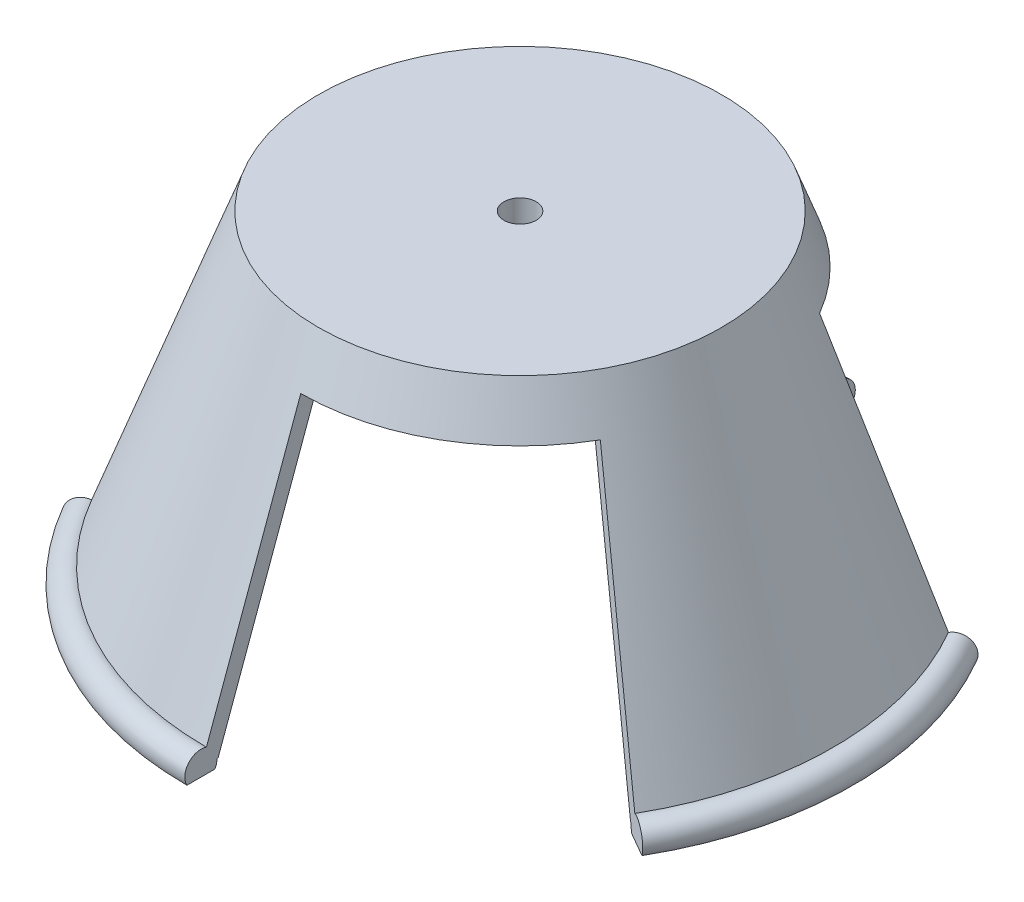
ISO-10303-21;
HEADER;
FILE_DESCRIPTION(('STEP AP214'),'2;1');
FILE_NAME('part.step','',(''),(''),'','','');
FILE_SCHEMA(('AUTOMOTIVE_DESIGN { 1 0 10303 214 1 1 1 1 }'));
ENDSEC;
DATA;
#1=APPLICATION_CONTEXT('core data for automotive mechanical design processes');
#2=APPLICATION_PROTOCOL_DEFINITION('international standard','automotive_design',2000,#1);
#3=PRODUCT_CONTEXT('',#1,'mechanical');
#4=PRODUCT('Part','Part','',(#3));
#5=PRODUCT_RELATED_PRODUCT_CATEGORY('part','',(#4));
#6=PRODUCT_DEFINITION_FORMATION('','',#4);
#7=PRODUCT_DEFINITION_CONTEXT('part definition',#1,'design');
#8=PRODUCT_DEFINITION('design','',#6,#7);
#9=PRODUCT_DEFINITION_SHAPE('','',#8);
#10=(LENGTH_UNIT() NAMED_UNIT(*) SI_UNIT(.MILLI.,.METRE.));
#11=(NAMED_UNIT(*) PLANE_ANGLE_UNIT() SI_UNIT($,.RADIAN.));
#12=(NAMED_UNIT(*) SI_UNIT($,.STERADIAN.) SOLID_ANGLE_UNIT());
#13=UNCERTAINTY_MEASURE_WITH_UNIT(LENGTH_MEASURE(1.E-05),#10,'distance_accuracy_value','');
#14=(GEOMETRIC_REPRESENTATION_CONTEXT(3) GLOBAL_UNCERTAINTY_ASSIGNED_CONTEXT((#13)) GLOBAL_UNIT_ASSIGNED_CONTEXT((#10,
#11,#12)) REPRESENTATION_CONTEXT('',''));
#15=CARTESIAN_POINT('',(0.,0.,0.));
#16=DIRECTION('',(0.,0.,1.));
#17=DIRECTION('',(1.,0.,0.));
#18=AXIS2_PLACEMENT_3D('',#15,#16,#17);
#19=CARTESIAN_POINT('',(0.,0.,0.));
#20=DIRECTION('',(0.,1.,0.));
#21=DIRECTION('',(0.,0.,1.));
#22=AXIS2_PLACEMENT_3D('',#19,#20,#21);
#23=TOROIDAL_SURFACE('',#22,19.7794046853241,1.);
#24=CARTESIAN_POINT('',(0.,-0.500000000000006,0.));
#25=DIRECTION('',(0.,-1.,0.));
#26=DIRECTION('',(0.,0.,-1.));
#27=AXIS2_PLACEMENT_3D('',#24,#25,#26);
#28=CIRCLE('',#27,18.9133792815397);
#29=CARTESIAN_POINT('',(0.,-0.500000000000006,-18.9133792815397));
#30=VERTEX_POINT('',#29);
#31=CARTESIAN_POINT('',(-16.3794669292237,-0.500000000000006,-9.45668964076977));
#32=VERTEX_POINT('',#31);
#33=EDGE_CURVE('E198',#30,#32,#28,.F.);
#34=ORIENTED_EDGE('',*,*,#33,.F.);
#35=CARTESIAN_POINT('',(0.,0.,-19.7794046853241));
#36=DIRECTION('',(-1.,0.,0.));
#37=DIRECTION('',(0.,0.,1.));
#38=AXIS2_PLACEMENT_3D('',#35,#36,#37);
#39=CIRCLE('',#38,1.);
#40=CARTESIAN_POINT('',(0.,0.,-18.7794046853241));
#41=VERTEX_POINT('',#40);
#42=EDGE_CURVE('E253',#41,#30,#39,.F.);
#43=ORIENTED_EDGE('',*,*,#42,.F.);
#44=CARTESIAN_POINT('',(0.,0.,0.));
#45=DIRECTION('',(0.,1.,0.));
#46=DIRECTION('',(0.,0.,1.));
#47=AXIS2_PLACEMENT_3D('',#44,#45,#46);
#48=CIRCLE('',#47,18.7794046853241);
#49=CARTESIAN_POINT('',(-16.2634415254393,0.,-9.38970234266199));
#50=VERTEX_POINT('',#49);
#51=EDGE_CURVE('E269',#41,#50,#48,.T.);
#52=ORIENTED_EDGE('',*,*,#51,.T.);
#53=CARTESIAN_POINT('',(-17.1294669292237,0.,-9.88970234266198));
#54=DIRECTION('',(0.499999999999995,0.,-0.866025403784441));
#55=DIRECTION('',(-0.866025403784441,0.,-0.499999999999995));
#56=AXIS2_PLACEMENT_3D('',#53,#54,#55);
#57=CIRCLE('',#56,1.);
#58=EDGE_CURVE('E216',#32,#50,#57,.F.);
#59=ORIENTED_EDGE('',*,*,#58,.F.);
#60=EDGE_LOOP('',(#34,#43,#52,#59));
#61=FACE_BOUND('',#60,.T.);
#62=ADVANCED_FACE('F51',(#61),#23,.T.);
#63=CARTESIAN_POINT('',(0.,-0.500000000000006,0.));
#64=DIRECTION('',(0.,-1.,0.));
#65=DIRECTION('',(0.,0.,-1.));
#66=AXIS2_PLACEMENT_3D('',#63,#64,#65);
#67=CIRCLE('',#66,18.9133792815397);
#68=CARTESIAN_POINT('',(-16.3794669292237,-0.500000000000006,9.45668964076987));
#69=VERTEX_POINT('',#68);
#70=CARTESIAN_POINT('',(1.88982622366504E-13,-0.500000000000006,18.9133792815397));
#71=VERTEX_POINT('',#70);
#72=EDGE_CURVE('E346',#69,#71,#67,.F.);
#73=ORIENTED_EDGE('',*,*,#72,.F.);
#74=CARTESIAN_POINT('',(-17.1294669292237,0.,9.88970234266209));
#75=DIRECTION('',(0.500000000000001,0.,0.866025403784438));
#76=DIRECTION('',(0.866025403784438,0.,-0.500000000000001));
#77=AXIS2_PLACEMENT_3D('',#74,#75,#76);
#78=CIRCLE('',#77,1.);
#79=CARTESIAN_POINT('',(-16.2634415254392,0.,9.38970234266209));
#80=VERTEX_POINT('',#79);
#81=EDGE_CURVE('E227',#80,#69,#78,.F.);
#82=ORIENTED_EDGE('',*,*,#81,.F.);
#83=CARTESIAN_POINT('',(1.87643947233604E-13,0.,18.7794046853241));
#84=VERTEX_POINT('',#83);
#85=EDGE_CURVE('E273',#80,#84,#48,.T.);
#86=ORIENTED_EDGE('',*,*,#85,.T.);
#87=CARTESIAN_POINT('',(1.9763595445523E-13,0.,19.7794046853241));
#88=DIRECTION('',(-1.,0.,0.));
#89=DIRECTION('',(0.,0.,1.));
#90=AXIS2_PLACEMENT_3D('',#87,#88,#89);
#91=CIRCLE('',#90,1.);
#92=EDGE_CURVE('E347',#71,#84,#91,.F.);
#93=ORIENTED_EDGE('',*,*,#92,.F.);
#94=EDGE_LOOP('',(#73,#82,#86,#93));
#95=FACE_BOUND('',#94,.T.);
#96=ADVANCED_FACE('F344',(#95),#23,.T.);
#97=CARTESIAN_POINT('',(0.,-0.500000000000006,0.));
#98=DIRECTION('',(0.,-1.,0.));
#99=DIRECTION('',(0.,0.,-1.));
#100=AXIS2_PLACEMENT_3D('',#97,#98,#99);
#101=CIRCLE('',#100,18.9133792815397);
#102=CARTESIAN_POINT('',(16.3794669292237,-0.500000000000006,9.45668964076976));
#103=VERTEX_POINT('',#102);
#104=CARTESIAN_POINT('',(16.3794669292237,-0.500000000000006,-9.45668964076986));
#105=VERTEX_POINT('',#104);
#106=EDGE_CURVE('E358',#103,#105,#101,.F.);
#107=ORIENTED_EDGE('',*,*,#106,.F.);
#108=CARTESIAN_POINT('',(17.1294669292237,0.,9.88970234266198));
#109=DIRECTION('',(0.499999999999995,0.,-0.866025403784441));
#110=DIRECTION('',(-0.866025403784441,0.,-0.499999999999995));
#111=AXIS2_PLACEMENT_3D('',#108,#109,#110);
#112=CIRCLE('',#111,1.);
#113=CARTESIAN_POINT('',(16.2634415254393,0.,9.38970234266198));
#114=VERTEX_POINT('',#113);
#115=EDGE_CURVE('E380',#114,#103,#112,.F.);
#116=ORIENTED_EDGE('',*,*,#115,.F.);
#117=CARTESIAN_POINT('',(16.2634415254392,0.,-9.38970234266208));
#118=VERTEX_POINT('',#117);
#119=EDGE_CURVE('E262',#114,#118,#48,.T.);
#120=ORIENTED_EDGE('',*,*,#119,.T.);
#121=CARTESIAN_POINT('',(17.1294669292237,0.,-9.88970234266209));
#122=DIRECTION('',(0.500000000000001,0.,0.866025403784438));
#123=DIRECTION('',(0.866025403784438,0.,-0.500000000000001));
#124=AXIS2_PLACEMENT_3D('',#121,#122,#123);
#125=CIRCLE('',#124,1.);
#126=EDGE_CURVE('E243',#105,#118,#125,.F.);
#127=ORIENTED_EDGE('',*,*,#126,.F.);
#128=EDGE_LOOP('',(#107,#116,#120,#127));
#129=FACE_BOUND('',#128,.T.);
#130=ADVANCED_FACE('F427',(#129),#23,.T.);
#131=CARTESIAN_POINT('',(0.,-0.500000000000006,0.));
#132=DIRECTION('',(0.,1.,0.));
#133=DIRECTION('',(0.,0.,1.));
#134=AXIS2_PLACEMENT_3D('',#131,#132,#133);
#135=CIRCLE('',#134,20.6454300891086);
#136=CARTESIAN_POINT('',(-17.8794669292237,-0.500000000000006,-10.3227150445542));
#137=VERTEX_POINT('',#136);
#138=CARTESIAN_POINT('',(0.,-0.500000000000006,-20.6454300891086));
#139=VERTEX_POINT('',#138);
#140=EDGE_CURVE('E195',#137,#139,#135,.F.);
#141=ORIENTED_EDGE('',*,*,#140,.F.);
#142=CARTESIAN_POINT('',(-16.8332687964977,0.939692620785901,-9.71869227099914));
#143=VERTEX_POINT('',#142);
#144=EDGE_CURVE('E207',#143,#137,#57,.F.);
#145=ORIENTED_EDGE('',*,*,#144,.F.);
#146=CARTESIAN_POINT('',(0.,0.939692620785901,0.));
#147=DIRECTION('',(0.,1.,0.));
#148=DIRECTION('',(0.,0.,1.));
#149=AXIS2_PLACEMENT_3D('',#146,#147,#148);
#150=CIRCLE('',#149,19.4373845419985);
#151=CARTESIAN_POINT('',(0.,0.939692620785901,-19.4373845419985));
#152=VERTEX_POINT('',#151);
#153=EDGE_CURVE('E274',#152,#143,#150,.T.);
#154=ORIENTED_EDGE('',*,*,#153,.F.);
#155=EDGE_CURVE('E209',#139,#152,#39,.F.);
#156=ORIENTED_EDGE('',*,*,#155,.F.);
#157=EDGE_LOOP('',(#141,#145,#154,#156));
#158=FACE_BOUND('',#157,.T.);
#159=ADVANCED_FACE('F205',(#158),#23,.T.);
#160=CARTESIAN_POINT('',(0.,-0.500000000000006,0.));
#161=DIRECTION('',(0.,1.,0.));
#162=DIRECTION('',(0.,0.,1.));
#163=AXIS2_PLACEMENT_3D('',#160,#161,#162);
#164=CIRCLE('',#163,20.6454300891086);
#165=CARTESIAN_POINT('',(2.06289286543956E-13,-0.500000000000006,20.6454300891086));
#166=VERTEX_POINT('',#165);
#167=CARTESIAN_POINT('',(-17.8794669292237,-0.500000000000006,10.3227150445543));
#168=VERTEX_POINT('',#167);
#169=EDGE_CURVE('E75',#166,#168,#164,.F.);
#170=ORIENTED_EDGE('',*,*,#169,.F.);
#171=CARTESIAN_POINT('',(1.94218486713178E-13,0.939692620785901,19.4373845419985));
#172=VERTEX_POINT('',#171);
#173=EDGE_CURVE('E373',#172,#166,#91,.F.);
#174=ORIENTED_EDGE('',*,*,#173,.F.);
#175=CARTESIAN_POINT('',(-16.8332687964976,0.939692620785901,9.71869227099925));
#176=VERTEX_POINT('',#175);
#177=EDGE_CURVE('E277',#176,#172,#150,.T.);
#178=ORIENTED_EDGE('',*,*,#177,.F.);
#179=EDGE_CURVE('E226',#168,#176,#78,.F.);
#180=ORIENTED_EDGE('',*,*,#179,.F.);
#181=EDGE_LOOP('',(#170,#174,#178,#180));
#182=FACE_BOUND('',#181,.T.);
#183=ADVANCED_FACE('F431',(#182),#23,.T.);
#184=CARTESIAN_POINT('',(0.,0.,0.));
#185=DIRECTION('',(0.,-1.,0.));
#186=DIRECTION('',(0.,0.,-1.));
#187=AXIS2_PLACEMENT_3D('',#184,#185,#186);
#188=PLANE('',#187);
#189=DIRECTION('',(-0.866025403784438,0.,0.500000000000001));
#190=VECTOR('',#189,1.);
#191=CARTESIAN_POINT('',(0.,0.,0.));
#192=LINE('',#191,#190);
#193=CARTESIAN_POINT('',(-16.2078619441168,0.,9.35761345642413));
#194=VERTEX_POINT('',#193);
#195=EDGE_CURVE('E218',#194,#80,#192,.T.);
#196=ORIENTED_EDGE('',*,*,#195,.F.);
#197=CARTESIAN_POINT('',(0.,0.,0.));
#198=DIRECTION('',(0.,-1.,0.));
#199=DIRECTION('',(0.,0.,-1.));
#200=AXIS2_PLACEMENT_3D('',#197,#198,#199);
#201=CIRCLE('',#200,18.7152269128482);
#202=CARTESIAN_POINT('',(1.87002682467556E-13,0.,18.7152269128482));
#203=VERTEX_POINT('',#202);
#204=EDGE_CURVE('E268',#194,#203,#201,.F.);
#205=ORIENTED_EDGE('',*,*,#204,.T.);
#206=DIRECTION('',(0.,0.,-1.));
#207=VECTOR('',#206,1.);
#208=CARTESIAN_POINT('',(0.,0.,0.));
#209=LINE('',#208,#207);
#210=EDGE_CURVE('E337',#84,#203,#209,.T.);
#211=ORIENTED_EDGE('',*,*,#210,.F.);
#212=ORIENTED_EDGE('',*,*,#85,.F.);
#213=EDGE_LOOP('',(#196,#205,#211,#212));
#214=FACE_BOUND('',#213,.T.);
#215=ADVANCED_FACE('F335',(#214),#188,.T.);
#216=DIRECTION('',(0.866025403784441,0.,0.499999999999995));
#217=VECTOR('',#216,1.);
#218=CARTESIAN_POINT('',(0.,0.,0.));
#219=LINE('',#218,#217);
#220=CARTESIAN_POINT('',(16.2078619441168,0.,9.35761345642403));
#221=VERTEX_POINT('',#220);
#222=EDGE_CURVE('E332',#221,#114,#219,.T.);
#223=ORIENTED_EDGE('',*,*,#222,.F.);
#224=CARTESIAN_POINT('',(16.2078619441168,0.,-9.35761345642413));
#225=VERTEX_POINT('',#224);
#226=EDGE_CURVE('E258',#221,#225,#201,.F.);
#227=ORIENTED_EDGE('',*,*,#226,.T.);
#228=DIRECTION('',(-0.866025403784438,0.,0.500000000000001));
#229=VECTOR('',#228,1.);
#230=CARTESIAN_POINT('',(0.,0.,0.));
#231=LINE('',#230,#229);
#232=EDGE_CURVE('E240',#118,#225,#231,.T.);
#233=ORIENTED_EDGE('',*,*,#232,.F.);
#234=ORIENTED_EDGE('',*,*,#119,.F.);
#235=EDGE_LOOP('',(#223,#227,#233,#234));
#236=FACE_BOUND('',#235,.T.);
#237=ADVANCED_FACE('F330',(#236),#188,.T.);
#238=CARTESIAN_POINT('',(0.,19.6579798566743,0.));
#239=DIRECTION('',(0.,-1.,0.));
#240=DIRECTION('',(0.,0.,-1.));
#241=AXIS2_PLACEMENT_3D('',#238,#239,#240);
#242=CONICAL_SURFACE('',#241,11.5603073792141,0.34906585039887);
#243=ORIENTED_EDGE('',*,*,#204,.F.);
#244=DIRECTION('',(-0.296198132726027,-0.939692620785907,0.171010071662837));
#245=VECTOR('',#244,1.);
#246=CARTESIAN_POINT('',(0.,51.4196633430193,0.));
#247=LINE('',#246,#245);
#248=CARTESIAN_POINT('',(-10.8493349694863,17.,6.26386646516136));
#249=VERTEX_POINT('',#248);
#250=EDGE_CURVE('E60',#194,#249,#247,.F.);
#251=ORIENTED_EDGE('',*,*,#250,.T.);
#252=CARTESIAN_POINT('',(0.,17.,0.));
#253=DIRECTION('',(0.,1.,0.));
#254=DIRECTION('',(0.,0.,1.));
#255=AXIS2_PLACEMENT_3D('',#252,#253,#254);
#256=CIRCLE('',#255,12.5277329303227);
#257=CARTESIAN_POINT('',(1.25177197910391E-13,17.,12.5277329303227));
#258=VERTEX_POINT('',#257);
#259=EDGE_CURVE('E263',#249,#258,#256,.T.);
#260=ORIENTED_EDGE('',*,*,#259,.T.);
#261=DIRECTION('',(0.,0.939692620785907,-0.342020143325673));
#262=VECTOR('',#261,1.);
#263=CARTESIAN_POINT('',(0.,51.4196633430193,0.));
#264=LINE('',#263,#262);
#265=EDGE_CURVE('E286',#258,#203,#264,.F.);
#266=ORIENTED_EDGE('',*,*,#265,.T.);
#267=EDGE_LOOP('',(#243,#251,#260,#266));
#268=FACE_BOUND('',#267,.T.);
#269=ADVANCED_FACE('F300',(#268),#242,.F.);
#270=ORIENTED_EDGE('',*,*,#226,.F.);
#271=DIRECTION('',(0.296198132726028,-0.939692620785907,0.171010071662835));
#272=VECTOR('',#271,1.);
#273=CARTESIAN_POINT('',(0.,51.4196633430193,0.));
#274=LINE('',#273,#272);
#275=CARTESIAN_POINT('',(10.8493349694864,17.,6.26386646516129));
#276=VERTEX_POINT('',#275);
#277=EDGE_CURVE('E289',#221,#276,#274,.F.);
#278=ORIENTED_EDGE('',*,*,#277,.T.);
#279=CARTESIAN_POINT('',(10.8493349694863,17.,-6.26386646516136));
#280=VERTEX_POINT('',#279);
#281=EDGE_CURVE('E264',#276,#280,#256,.T.);
#282=ORIENTED_EDGE('',*,*,#281,.T.);
#283=DIRECTION('',(-0.296198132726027,0.939692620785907,0.171010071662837));
#284=VECTOR('',#283,1.);
#285=CARTESIAN_POINT('',(0.,51.4196633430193,0.));
#286=LINE('',#285,#284);
#287=EDGE_CURVE('E280',#280,#225,#286,.F.);
#288=ORIENTED_EDGE('',*,*,#287,.T.);
#289=EDGE_LOOP('',(#270,#278,#282,#288));
#290=FACE_BOUND('',#289,.T.);
#291=ADVANCED_FACE('F316',(#290),#242,.F.);
#292=CARTESIAN_POINT('',(-12.5,20.,0.));
#293=DIRECTION('',(0.,1.,0.));
#294=DIRECTION('',(0.,0.,1.));
#295=AXIS2_PLACEMENT_3D('',#292,#293,#294);
#296=PLANE('',#295);
#297=CARTESIAN_POINT('',(0.,20.,0.));
#298=DIRECTION('',(0.,1.,0.));
#299=DIRECTION('',(0.,0.,1.));
#300=AXIS2_PLACEMENT_3D('',#297,#298,#299);
#301=CIRCLE('',#300,1.);
#302=CARTESIAN_POINT('',(0.,20.,1.));
#303=VERTEX_POINT('',#302);
#304=EDGE_CURVE('E404',#303,#303,#301,.T.);
#305=ORIENTED_EDGE('',*,*,#304,.F.);
#306=EDGE_LOOP('',(#305));
#307=FACE_BOUND('',#306,.T.);
#308=CARTESIAN_POINT('',(0.,20.,0.));
#309=DIRECTION('',(0.,1.,0.));
#310=DIRECTION('',(0.,0.,1.));
#311=AXIS2_PLACEMENT_3D('',#308,#309,#310);
#312=CIRCLE('',#311,12.5);
#313=CARTESIAN_POINT('',(0.,20.,12.5));
#314=VERTEX_POINT('',#313);
#315=EDGE_CURVE('E276',#314,#314,#312,.T.);
#316=ORIENTED_EDGE('',*,*,#315,.T.);
#317=EDGE_LOOP('',(#316));
#318=FACE_BOUND('',#317,.T.);
#319=ADVANCED_FACE('F53',(#307,#318),#296,.T.);
#320=CARTESIAN_POINT('',(0.,20.,0.));
#321=DIRECTION('',(0.,-1.,0.));
#322=DIRECTION('',(0.,0.,-1.));
#323=AXIS2_PLACEMENT_3D('',#320,#321,#322);
#324=CONICAL_SURFACE('',#323,12.5,0.34906585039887);
#325=DIRECTION('',(-0.296198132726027,-0.939692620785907,0.171010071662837));
#326=VECTOR('',#325,1.);
#327=CARTESIAN_POINT('',(0.,54.3434677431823,0.));
#328=LINE('',#327,#326);
#329=CARTESIAN_POINT('',(-11.7709399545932,17.,6.79595535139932));
#330=VERTEX_POINT('',#329);
#331=EDGE_CURVE('E230',#176,#330,#328,.F.);
#332=ORIENTED_EDGE('',*,*,#331,.F.);
#333=ORIENTED_EDGE('',*,*,#177,.T.);
#334=DIRECTION('',(0.,0.939692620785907,-0.342020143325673));
#335=VECTOR('',#334,1.);
#336=CARTESIAN_POINT('',(0.,54.3434677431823,0.));
#337=LINE('',#336,#335);
#338=CARTESIAN_POINT('',(1.35810469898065E-13,17.,13.5919107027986));
#339=VERTEX_POINT('',#338);
#340=EDGE_CURVE('E376',#339,#172,#337,.F.);
#341=ORIENTED_EDGE('',*,*,#340,.F.);
#342=CARTESIAN_POINT('',(0.,17.,0.));
#343=DIRECTION('',(0.,-1.,0.));
#344=DIRECTION('',(0.,0.,-1.));
#345=AXIS2_PLACEMENT_3D('',#342,#343,#344);
#346=CIRCLE('',#345,13.5919107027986);
#347=CARTESIAN_POINT('',(11.7709399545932,17.,6.79595535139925));
#348=VERTEX_POINT('',#347);
#349=EDGE_CURVE('E367',#339,#348,#346,.F.);
#350=ORIENTED_EDGE('',*,*,#349,.T.);
#351=DIRECTION('',(0.296198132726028,-0.939692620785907,0.171010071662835));
#352=VECTOR('',#351,1.);
#353=CARTESIAN_POINT('',(0.,54.3434677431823,0.));
#354=LINE('',#353,#352);
#355=CARTESIAN_POINT('',(16.8332687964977,0.939692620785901,9.71869227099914));
#356=VERTEX_POINT('',#355);
#357=EDGE_CURVE('E383',#356,#348,#354,.F.);
#358=ORIENTED_EDGE('',*,*,#357,.F.);
#359=CARTESIAN_POINT('',(16.8332687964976,0.939692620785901,-9.71869227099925));
#360=VERTEX_POINT('',#359);
#361=EDGE_CURVE('E272',#356,#360,#150,.T.);
#362=ORIENTED_EDGE('',*,*,#361,.T.);
#363=DIRECTION('',(-0.296198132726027,0.939692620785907,0.171010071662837));
#364=VECTOR('',#363,1.);
#365=CARTESIAN_POINT('',(0.,54.3434677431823,0.));
#366=LINE('',#365,#364);
#367=CARTESIAN_POINT('',(11.7709399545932,17.,-6.79595535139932));
#368=VERTEX_POINT('',#367);
#369=EDGE_CURVE('E247',#368,#360,#366,.F.);
#370=ORIENTED_EDGE('',*,*,#369,.F.);
#371=CARTESIAN_POINT('',(0.,17.,0.));
#372=DIRECTION('',(0.,-1.,0.));
#373=DIRECTION('',(0.,0.,-1.));
#374=AXIS2_PLACEMENT_3D('',#371,#372,#373);
#375=CIRCLE('',#374,13.5919107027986);
#376=CARTESIAN_POINT('',(0.,17.,-13.5919107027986));
#377=VERTEX_POINT('',#376);
#378=EDGE_CURVE('E237',#368,#377,#375,.F.);
#379=ORIENTED_EDGE('',*,*,#378,.T.);
#380=DIRECTION('',(0.,-0.939692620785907,-0.342020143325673));
#381=VECTOR('',#380,1.);
#382=CARTESIAN_POINT('',(0.,54.3434677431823,0.));
#383=LINE('',#382,#381);
#384=EDGE_CURVE('E256',#152,#377,#383,.F.);
#385=ORIENTED_EDGE('',*,*,#384,.F.);
#386=ORIENTED_EDGE('',*,*,#153,.T.);
#387=DIRECTION('',(0.296198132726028,0.939692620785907,0.171010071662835));
#388=VECTOR('',#387,1.);
#389=CARTESIAN_POINT('',(0.,54.3434677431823,0.));
#390=LINE('',#389,#388);
#391=CARTESIAN_POINT('',(-11.7709399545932,17.,-6.79595535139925));
#392=VERTEX_POINT('',#391);
#393=EDGE_CURVE('E215',#392,#143,#390,.F.);
#394=ORIENTED_EDGE('',*,*,#393,.F.);
#395=CARTESIAN_POINT('',(0.,17.,0.));
#396=DIRECTION('',(0.,-1.,0.));
#397=DIRECTION('',(0.,0.,-1.));
#398=AXIS2_PLACEMENT_3D('',#395,#396,#397);
#399=CIRCLE('',#398,13.5919107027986);
#400=EDGE_CURVE('E384',#392,#330,#399,.F.);
#401=ORIENTED_EDGE('',*,*,#400,.T.);
#402=EDGE_LOOP('',(#332,#333,#341,#350,#358,#362,#370,#379,#385,#386,#394,#401));
#403=FACE_BOUND('',#402,.T.);
#404=ORIENTED_EDGE('',*,*,#315,.F.);
#405=EDGE_LOOP('',(#404));
#406=FACE_BOUND('',#405,.T.);
#407=ADVANCED_FACE('F399',(#403,#406),#324,.T.);
#408=CARTESIAN_POINT('',(0.,-0.500000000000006,0.));
#409=DIRECTION('',(0.,1.,0.));
#410=DIRECTION('',(0.,0.,1.));
#411=AXIS2_PLACEMENT_3D('',#408,#409,#410);
#412=CIRCLE('',#411,20.6454300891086);
#413=CARTESIAN_POINT('',(17.8794669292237,-0.500000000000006,-10.3227150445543));
#414=VERTEX_POINT('',#413);
#415=CARTESIAN_POINT('',(17.8794669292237,-0.500000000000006,10.3227150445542));
#416=VERTEX_POINT('',#415);
#417=EDGE_CURVE('E67',#414,#416,#412,.F.);
#418=ORIENTED_EDGE('',*,*,#417,.F.);
#419=EDGE_CURVE('E244',#360,#414,#125,.F.);
#420=ORIENTED_EDGE('',*,*,#419,.F.);
#421=ORIENTED_EDGE('',*,*,#361,.F.);
#422=EDGE_CURVE('E379',#416,#356,#112,.F.);
#423=ORIENTED_EDGE('',*,*,#422,.F.);
#424=EDGE_LOOP('',(#418,#420,#421,#423));
#425=FACE_BOUND('',#424,.T.);
#426=ADVANCED_FACE('F424',(#425),#23,.T.);
#427=DIRECTION('',(0.866025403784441,0.,0.499999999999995));
#428=VECTOR('',#427,1.);
#429=CARTESIAN_POINT('',(0.,0.,0.));
#430=LINE('',#429,#428);
#431=CARTESIAN_POINT('',(-16.2078619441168,0.,-9.35761345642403));
#432=VERTEX_POINT('',#431);
#433=EDGE_CURVE('E220',#50,#432,#430,.T.);
#434=ORIENTED_EDGE('',*,*,#433,.F.);
#435=ORIENTED_EDGE('',*,*,#51,.F.);
#436=DIRECTION('',(0.,0.,-1.));
#437=VECTOR('',#436,1.);
#438=CARTESIAN_POINT('',(0.,0.,0.));
#439=LINE('',#438,#437);
#440=CARTESIAN_POINT('',(0.,0.,-18.7152269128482));
#441=VERTEX_POINT('',#440);
#442=EDGE_CURVE('E250',#441,#41,#439,.T.);
#443=ORIENTED_EDGE('',*,*,#442,.F.);
#444=EDGE_CURVE('E265',#441,#432,#201,.F.);
#445=ORIENTED_EDGE('',*,*,#444,.T.);
#446=EDGE_LOOP('',(#434,#435,#443,#445));
#447=FACE_BOUND('',#446,.T.);
#448=ADVANCED_FACE('F396',(#447),#188,.T.);
#449=CARTESIAN_POINT('',(-12.5,17.,0.));
#450=DIRECTION('',(0.,1.,0.));
#451=DIRECTION('',(0.,0.,1.));
#452=AXIS2_PLACEMENT_3D('',#449,#450,#451);
#453=PLANE('',#452);
#454=CARTESIAN_POINT('',(0.,17.,0.));
#455=DIRECTION('',(0.,1.,0.));
#456=DIRECTION('',(0.,0.,1.));
#457=AXIS2_PLACEMENT_3D('',#454,#455,#456);
#458=CIRCLE('',#457,1.);
#459=CARTESIAN_POINT('',(0.,17.,1.));
#460=VERTEX_POINT('',#459);
#461=EDGE_CURVE('E55',#460,#460,#458,.T.);
#462=ORIENTED_EDGE('',*,*,#461,.T.);
#463=EDGE_LOOP('',(#462));
#464=FACE_BOUND('',#463,.T.);
#465=ORIENTED_EDGE('',*,*,#259,.F.);
#466=DIRECTION('',(0.866025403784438,0.,-0.500000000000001));
#467=VECTOR('',#466,1.);
#468=CARTESIAN_POINT('',(0.,17.,0.));
#469=LINE('',#468,#467);
#470=EDGE_CURVE('E307',#330,#249,#469,.T.);
#471=ORIENTED_EDGE('',*,*,#470,.F.);
#472=ORIENTED_EDGE('',*,*,#400,.F.);
#473=DIRECTION('',(-0.866025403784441,0.,-0.499999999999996));
#474=VECTOR('',#473,1.);
#475=CARTESIAN_POINT('',(0.,17.,0.));
#476=LINE('',#475,#474);
#477=CARTESIAN_POINT('',(-10.8493349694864,17.,-6.2638664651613));
#478=VERTEX_POINT('',#477);
#479=EDGE_CURVE('E365',#478,#392,#476,.T.);
#480=ORIENTED_EDGE('',*,*,#479,.F.);
#481=CARTESIAN_POINT('',(0.,17.,-12.5277329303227));
#482=VERTEX_POINT('',#481);
#483=EDGE_CURVE('E259',#482,#478,#256,.T.);
#484=ORIENTED_EDGE('',*,*,#483,.F.);
#485=DIRECTION('',(0.,0.,1.));
#486=VECTOR('',#485,1.);
#487=CARTESIAN_POINT('',(0.,17.,0.));
#488=LINE('',#487,#486);
#489=EDGE_CURVE('E232',#377,#482,#488,.T.);
#490=ORIENTED_EDGE('',*,*,#489,.F.);
#491=ORIENTED_EDGE('',*,*,#378,.F.);
#492=DIRECTION('',(0.866025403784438,0.,-0.500000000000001));
#493=VECTOR('',#492,1.);
#494=CARTESIAN_POINT('',(0.,17.,0.));
#495=LINE('',#494,#493);
#496=EDGE_CURVE('E234',#280,#368,#495,.T.);
#497=ORIENTED_EDGE('',*,*,#496,.F.);
#498=ORIENTED_EDGE('',*,*,#281,.F.);
#499=DIRECTION('',(-0.866025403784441,0.,-0.499999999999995));
#500=VECTOR('',#499,1.);
#501=CARTESIAN_POINT('',(0.,17.,0.));
#502=LINE('',#501,#500);
#503=EDGE_CURVE('E363',#348,#276,#502,.T.);
#504=ORIENTED_EDGE('',*,*,#503,.F.);
#505=ORIENTED_EDGE('',*,*,#349,.F.);
#506=DIRECTION('',(0.,0.,1.));
#507=VECTOR('',#506,1.);
#508=CARTESIAN_POINT('',(0.,17.,0.));
#509=LINE('',#508,#507);
#510=EDGE_CURVE('E310',#258,#339,#509,.T.);
#511=ORIENTED_EDGE('',*,*,#510,.F.);
#512=EDGE_LOOP('',(#465,#471,#472,#480,#484,#490,#491,#497,#498,#504,#505,#511));
#513=FACE_BOUND('',#512,.T.);
#514=ADVANCED_FACE('F306',(#464,#513),#453,.F.);
#515=ORIENTED_EDGE('',*,*,#483,.T.);
#516=DIRECTION('',(0.296198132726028,0.939692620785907,0.171010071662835));
#517=VECTOR('',#516,1.);
#518=CARTESIAN_POINT('',(0.,51.4196633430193,0.));
#519=LINE('',#518,#517);
#520=EDGE_CURVE('E292',#478,#432,#519,.F.);
#521=ORIENTED_EDGE('',*,*,#520,.T.);
#522=ORIENTED_EDGE('',*,*,#444,.F.);
#523=DIRECTION('',(0.,-0.939692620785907,-0.342020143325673));
#524=VECTOR('',#523,1.);
#525=CARTESIAN_POINT('',(0.,51.4196633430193,0.));
#526=LINE('',#525,#524);
#527=EDGE_CURVE('E283',#441,#482,#526,.F.);
#528=ORIENTED_EDGE('',*,*,#527,.T.);
#529=EDGE_LOOP('',(#515,#521,#522,#528));
#530=FACE_BOUND('',#529,.T.);
#531=ADVANCED_FACE('F393',(#530),#242,.F.);
#532=CARTESIAN_POINT('',(0.,-1.,0.));
#533=DIRECTION('',(-1.,0.,0.));
#534=DIRECTION('',(0.,0.,1.));
#535=AXIS2_PLACEMENT_3D('',#532,#533,#534);
#536=PLANE('',#535);
#537=ORIENTED_EDGE('',*,*,#42,.T.);
#538=DIRECTION('',(0.,0.,-1.));
#539=VECTOR('',#538,1.);
#540=CARTESIAN_POINT('',(0.,-0.500000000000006,0.));
#541=LINE('',#540,#539);
#542=EDGE_CURVE('E210',#30,#139,#541,.T.);
#543=ORIENTED_EDGE('',*,*,#542,.T.);
#544=ORIENTED_EDGE('',*,*,#155,.T.);
#545=ORIENTED_EDGE('',*,*,#384,.T.);
#546=ORIENTED_EDGE('',*,*,#489,.T.);
#547=ORIENTED_EDGE('',*,*,#527,.F.);
#548=ORIENTED_EDGE('',*,*,#442,.T.);
#549=EDGE_LOOP('',(#537,#543,#544,#545,#546,#547,#548));
#550=FACE_BOUND('',#549,.T.);
#551=ADVANCED_FACE('F398',(#550),#536,.F.);
#552=CARTESIAN_POINT('',(0.,-1.,0.));
#553=DIRECTION('',(0.500000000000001,0.,0.866025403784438));
#554=DIRECTION('',(0.866025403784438,0.,-0.500000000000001));
#555=AXIS2_PLACEMENT_3D('',#552,#553,#554);
#556=PLANE('',#555);
#557=ORIENTED_EDGE('',*,*,#419,.T.);
#558=DIRECTION('',(-0.866025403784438,0.,0.500000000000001));
#559=VECTOR('',#558,1.);
#560=CARTESIAN_POINT('',(0.,-0.500000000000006,0.));
#561=LINE('',#560,#559);
#562=EDGE_CURVE('E361',#414,#105,#561,.T.);
#563=ORIENTED_EDGE('',*,*,#562,.T.);
#564=ORIENTED_EDGE('',*,*,#126,.T.);
#565=ORIENTED_EDGE('',*,*,#232,.T.);
#566=ORIENTED_EDGE('',*,*,#287,.F.);
#567=ORIENTED_EDGE('',*,*,#496,.T.);
#568=ORIENTED_EDGE('',*,*,#369,.T.);
#569=EDGE_LOOP('',(#557,#563,#564,#565,#566,#567,#568));
#570=FACE_BOUND('',#569,.T.);
#571=ADVANCED_FACE('F322',(#570),#556,.F.);
#572=CARTESIAN_POINT('',(0.,-1.,0.));
#573=DIRECTION('',(0.499999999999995,0.,-0.866025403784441));
#574=DIRECTION('',(-0.866025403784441,0.,-0.499999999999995));
#575=AXIS2_PLACEMENT_3D('',#572,#573,#574);
#576=PLANE('',#575);
#577=ORIENTED_EDGE('',*,*,#115,.T.);
#578=DIRECTION('',(0.866025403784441,0.,0.499999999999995));
#579=VECTOR('',#578,1.);
#580=CARTESIAN_POINT('',(0.,-0.500000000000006,0.));
#581=LINE('',#580,#579);
#582=EDGE_CURVE('E356',#103,#416,#581,.T.);
#583=ORIENTED_EDGE('',*,*,#582,.T.);
#584=ORIENTED_EDGE('',*,*,#422,.T.);
#585=ORIENTED_EDGE('',*,*,#357,.T.);
#586=ORIENTED_EDGE('',*,*,#503,.T.);
#587=ORIENTED_EDGE('',*,*,#277,.F.);
#588=ORIENTED_EDGE('',*,*,#222,.T.);
#589=EDGE_LOOP('',(#577,#583,#584,#585,#586,#587,#588));
#590=FACE_BOUND('',#589,.T.);
#591=ADVANCED_FACE('F454',(#590),#576,.F.);
#592=CARTESIAN_POINT('',(0.,-1.,0.));
#593=DIRECTION('',(-1.,0.,0.));
#594=DIRECTION('',(0.,0.,1.));
#595=AXIS2_PLACEMENT_3D('',#592,#593,#594);
#596=PLANE('',#595);
#597=ORIENTED_EDGE('',*,*,#173,.T.);
#598=DIRECTION('',(0.,0.,-1.));
#599=VECTOR('',#598,1.);
#600=CARTESIAN_POINT('',(0.,-0.500000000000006,0.));
#601=LINE('',#600,#599);
#602=EDGE_CURVE('E350',#166,#71,#601,.T.);
#603=ORIENTED_EDGE('',*,*,#602,.T.);
#604=ORIENTED_EDGE('',*,*,#92,.T.);
#605=ORIENTED_EDGE('',*,*,#210,.T.);
#606=ORIENTED_EDGE('',*,*,#265,.F.);
#607=ORIENTED_EDGE('',*,*,#510,.T.);
#608=ORIENTED_EDGE('',*,*,#340,.T.);
#609=EDGE_LOOP('',(#597,#603,#604,#605,#606,#607,#608));
#610=FACE_BOUND('',#609,.T.);
#611=ADVANCED_FACE('F447',(#610),#596,.F.);
#612=CARTESIAN_POINT('',(0.,-1.,0.));
#613=DIRECTION('',(0.500000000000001,0.,0.866025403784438));
#614=DIRECTION('',(0.866025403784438,0.,-0.500000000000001));
#615=AXIS2_PLACEMENT_3D('',#612,#613,#614);
#616=PLANE('',#615);
#617=ORIENTED_EDGE('',*,*,#81,.T.);
#618=DIRECTION('',(-0.866025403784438,0.,0.500000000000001));
#619=VECTOR('',#618,1.);
#620=CARTESIAN_POINT('',(0.,-0.500000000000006,0.));
#621=LINE('',#620,#619);
#622=EDGE_CURVE('E340',#69,#168,#621,.T.);
#623=ORIENTED_EDGE('',*,*,#622,.T.);
#624=ORIENTED_EDGE('',*,*,#179,.T.);
#625=ORIENTED_EDGE('',*,*,#331,.T.);
#626=ORIENTED_EDGE('',*,*,#470,.T.);
#627=ORIENTED_EDGE('',*,*,#250,.F.);
#628=ORIENTED_EDGE('',*,*,#195,.T.);
#629=EDGE_LOOP('',(#617,#623,#624,#625,#626,#627,#628));
#630=FACE_BOUND('',#629,.T.);
#631=ADVANCED_FACE('F339',(#630),#616,.F.);
#632=CARTESIAN_POINT('',(0.,-1.,0.));
#633=DIRECTION('',(0.499999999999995,0.,-0.866025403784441));
#634=DIRECTION('',(-0.866025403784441,0.,-0.499999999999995));
#635=AXIS2_PLACEMENT_3D('',#632,#633,#634);
#636=PLANE('',#635);
#637=ORIENTED_EDGE('',*,*,#144,.T.);
#638=DIRECTION('',(0.866025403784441,0.,0.499999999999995));
#639=VECTOR('',#638,1.);
#640=CARTESIAN_POINT('',(0.,-0.500000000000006,0.));
#641=LINE('',#640,#639);
#642=EDGE_CURVE('E11',#137,#32,#641,.T.);
#643=ORIENTED_EDGE('',*,*,#642,.T.);
#644=ORIENTED_EDGE('',*,*,#58,.T.);
#645=ORIENTED_EDGE('',*,*,#433,.T.);
#646=ORIENTED_EDGE('',*,*,#520,.F.);
#647=ORIENTED_EDGE('',*,*,#479,.T.);
#648=ORIENTED_EDGE('',*,*,#393,.T.);
#649=EDGE_LOOP('',(#637,#643,#644,#645,#646,#647,#648));
#650=FACE_BOUND('',#649,.T.);
#651=ADVANCED_FACE('F212',(#650),#636,.F.);
#652=CARTESIAN_POINT('',(0.,-0.500000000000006,0.));
#653=DIRECTION('',(0.,1.,0.));
#654=DIRECTION('',(0.,0.,1.));
#655=AXIS2_PLACEMENT_3D('',#652,#653,#654);
#656=PLANE('',#655);
#657=ORIENTED_EDGE('',*,*,#33,.T.);
#658=ORIENTED_EDGE('',*,*,#642,.F.);
#659=ORIENTED_EDGE('',*,*,#140,.T.);
#660=ORIENTED_EDGE('',*,*,#542,.F.);
#661=EDGE_LOOP('',(#657,#658,#659,#660));
#662=FACE_BOUND('',#661,.T.);
#663=ADVANCED_FACE('F194',(#662),#656,.F.);
#664=ORIENTED_EDGE('',*,*,#169,.T.);
#665=ORIENTED_EDGE('',*,*,#622,.F.);
#666=ORIENTED_EDGE('',*,*,#72,.T.);
#667=ORIENTED_EDGE('',*,*,#602,.F.);
#668=EDGE_LOOP('',(#664,#665,#666,#667));
#669=FACE_BOUND('',#668,.T.);
#670=ADVANCED_FACE('F420',(#669),#656,.F.);
#671=ORIENTED_EDGE('',*,*,#417,.T.);
#672=ORIENTED_EDGE('',*,*,#582,.F.);
#673=ORIENTED_EDGE('',*,*,#106,.T.);
#674=ORIENTED_EDGE('',*,*,#562,.F.);
#675=EDGE_LOOP('',(#671,#672,#673,#674));
#676=FACE_BOUND('',#675,.T.);
#677=ADVANCED_FACE('F414',(#676),#656,.F.);
#678=CARTESIAN_POINT('',(0.,-0.500000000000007,0.));
#679=DIRECTION('',(0.,1.,0.));
#680=DIRECTION('',(0.,0.,1.));
#681=AXIS2_PLACEMENT_3D('',#678,#679,#680);
#682=CYLINDRICAL_SURFACE('',#681,1.);
#683=CARTESIAN_POINT('',(0.,20.,1.));
#684=CARTESIAN_POINT('',(0.,19.96875,1.));
#685=CARTESIAN_POINT('',(0.,19.9375,1.));
#686=CARTESIAN_POINT('',(0.,19.875,1.));
#687=CARTESIAN_POINT('',(0.,19.84375,1.));
#688=CARTESIAN_POINT('',(0.,19.78125,1.));
#689=CARTESIAN_POINT('',(0.,19.75,1.));
#690=CARTESIAN_POINT('',(0.,19.6875,1.));
#691=CARTESIAN_POINT('',(0.,19.65625,1.));
#692=CARTESIAN_POINT('',(0.,19.59375,1.));
#693=CARTESIAN_POINT('',(0.,19.5625,1.));
#694=CARTESIAN_POINT('',(0.,19.5,1.));
#695=CARTESIAN_POINT('',(0.,19.46875,1.));
#696=CARTESIAN_POINT('',(0.,19.40625,1.));
#697=CARTESIAN_POINT('',(0.,19.375,1.));
#698=CARTESIAN_POINT('',(0.,19.3125,1.));
#699=CARTESIAN_POINT('',(0.,19.28125,1.));
#700=CARTESIAN_POINT('',(0.,19.21875,1.));
#701=CARTESIAN_POINT('',(0.,19.1875,1.));
#702=CARTESIAN_POINT('',(0.,19.125,1.));
#703=CARTESIAN_POINT('',(0.,19.09375,1.));
#704=CARTESIAN_POINT('',(0.,19.03125,1.));
#705=CARTESIAN_POINT('',(0.,19.,1.));
#706=CARTESIAN_POINT('',(0.,18.9375,1.));
#707=CARTESIAN_POINT('',(0.,18.90625,1.));
#708=CARTESIAN_POINT('',(0.,18.84375,1.));
#709=CARTESIAN_POINT('',(0.,18.8125,1.));
#710=CARTESIAN_POINT('',(0.,18.75,1.));
#711=CARTESIAN_POINT('',(0.,18.71875,1.));
#712=CARTESIAN_POINT('',(0.,18.65625,1.));
#713=CARTESIAN_POINT('',(0.,18.625,1.));
#714=CARTESIAN_POINT('',(0.,18.5625,1.));
#715=CARTESIAN_POINT('',(0.,18.53125,1.));
#716=CARTESIAN_POINT('',(0.,18.46875,1.));
#717=CARTESIAN_POINT('',(0.,18.4375,1.));
#718=CARTESIAN_POINT('',(0.,18.375,1.));
#719=CARTESIAN_POINT('',(0.,18.34375,1.));
#720=CARTESIAN_POINT('',(0.,18.28125,1.));
#721=CARTESIAN_POINT('',(0.,18.25,1.));
#722=CARTESIAN_POINT('',(0.,18.1875,1.));
#723=CARTESIAN_POINT('',(0.,18.15625,1.));
#724=CARTESIAN_POINT('',(0.,18.09375,1.));
#725=CARTESIAN_POINT('',(0.,18.0625,1.));
#726=CARTESIAN_POINT('',(0.,18.,1.));
#727=CARTESIAN_POINT('',(0.,17.96875,1.));
#728=CARTESIAN_POINT('',(0.,17.90625,1.));
#729=CARTESIAN_POINT('',(0.,17.875,1.));
#730=CARTESIAN_POINT('',(0.,17.8125,1.));
#731=CARTESIAN_POINT('',(0.,17.78125,1.));
#732=CARTESIAN_POINT('',(0.,17.71875,1.));
#733=CARTESIAN_POINT('',(0.,17.6875,1.));
#734=CARTESIAN_POINT('',(0.,17.625,1.));
#735=CARTESIAN_POINT('',(0.,17.59375,1.));
#736=CARTESIAN_POINT('',(0.,17.53125,1.));
#737=CARTESIAN_POINT('',(0.,17.5,1.));
#738=CARTESIAN_POINT('',(0.,17.4375,1.));
#739=CARTESIAN_POINT('',(0.,17.40625,1.));
#740=CARTESIAN_POINT('',(0.,17.34375,1.));
#741=CARTESIAN_POINT('',(0.,17.3125,1.));
#742=CARTESIAN_POINT('',(0.,17.25,1.));
#743=CARTESIAN_POINT('',(0.,17.21875,1.));
#744=CARTESIAN_POINT('',(0.,17.15625,1.));
#745=CARTESIAN_POINT('',(0.,17.125,1.));
#746=CARTESIAN_POINT('',(0.,17.0625,1.));
#747=CARTESIAN_POINT('',(0.,17.03125,1.));
#748=CARTESIAN_POINT('',(0.,17.,1.));
#749=B_SPLINE_CURVE_WITH_KNOTS('',3,(#683,#684,#685,#686,#687,#688,#689,#690,#691,#692,#693,
#694,#695,#696,#697,#698,#699,#700,#701,#702,#703,#704,#705,#706,#707,#708,#709,#710,#711,#712,
#713,#714,#715,#716,#717,#718,#719,#720,#721,#722,#723,#724,#725,#726,#727,#728,#729,#730,#731,
#732,#733,#734,#735,#736,#737,#738,#739,#740,#741,#742,#743,#744,#745,#746,#747,#748),
.UNSPECIFIED.,.F.,.F.,(4,2,2,2,2,2,2,2,2,2,2,2,2,2,2,2,2,2,2,2,2,2,2,2,2,2,2,2,2,2,2,2,4),(0.,
0.0937500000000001,0.1875,0.28125,0.375,0.46875,0.5625,0.656250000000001,0.750000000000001,
0.843749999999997,0.937499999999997,1.03125,1.125,1.21875,1.3125,1.40625,1.5,1.59375,1.6875,
1.78125,1.875,1.96875,2.0625,2.15625,2.25,2.34375,2.4375,2.53125,2.625,2.71875,2.8125,2.90625,
3.),.UNSPECIFIED.);
#750=EDGE_CURVE('BSEAM412',#303,#460,#749,.T.);
#751=ORIENTED_EDGE('',*,*,#304,.T.);
#752=ORIENTED_EDGE('',*,*,#461,.F.);
#753=ORIENTED_EDGE('',*,*,#750,.T.);
#754=ORIENTED_EDGE('',*,*,#750,.F.);
#755=EDGE_LOOP('',(#751,#753,#752,#754));
#756=FACE_BOUND('',#755,.T.);
#757=ADVANCED_FACE('F412',(#756),#682,.F.);
#758=CLOSED_SHELL('',(#62,#96,#130,#159,#183,#215,#237,#269,#291,#319,#407,#426,#448,#514,#531,
#551,#571,#591,#611,#631,#651,#663,#670,#677,#757));
#759=MANIFOLD_SOLID_BREP('B2',#758);
#760=ADVANCED_BREP_SHAPE_REPRESENTATION('',(#18,#759),#14);
#761=SHAPE_DEFINITION_REPRESENTATION(#9,#760);
ENDSEC;
END-ISO-10303-21;
